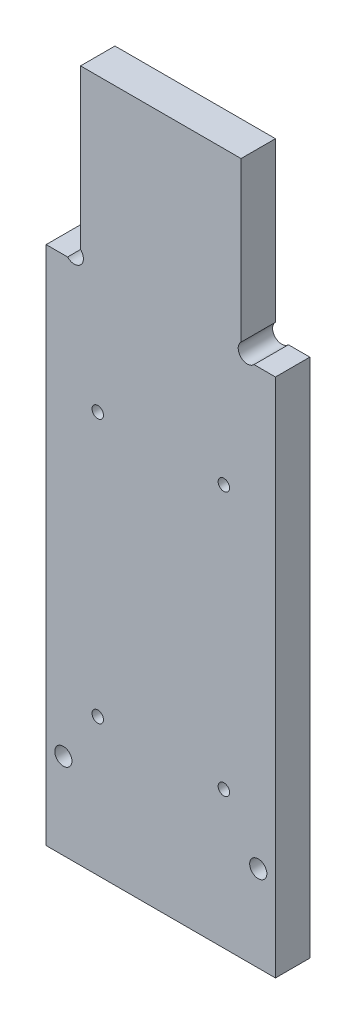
from build123d import *

# Parameters (mm, degrees)
ESQUISSE1_W             = 40
ESQUISSE1_H             = 120.8
BASE_EXTRUSION_DEPTH    = 6
ESQUISSE3_W             = 6
ESQUISSE3_H             = 30
ENL_V_MAT_EXTRU_2_DEPTH = 6
ESQUISSE2_R             = 1.5
ENL_V_MAT_EXTRU_1_DEPTH = 6
ESQUISSE5_R             = 1.6
ENL_V_MAT_EXTRU_3_DEPTH = 6
ESQUISSE6_R             = 1
ENL_V_MAT_EXTRU_4_DEPTH = 5


with BuildPart() as part:
    # Esquisse1 → Base-Extrusion (new body)
    with BuildSketch(Plane.XY):
        with Locations((-40.918360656, -10.932459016)):
            Rectangle(ESQUISSE1_W, ESQUISSE1_H)
    extrude(amount=BASE_EXTRUSION_DEPTH)

    # Esquisse3 → Enl_v. mat.-Extru.2 (cut)
    with BuildSketch(Plane.XY.offset(6)):
        with Locations((-57.918360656, 34.467540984)):
            Rectangle(ESQUISSE3_W, ESQUISSE3_H)
        with Locations((-23.918360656, 34.467540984)):
            Rectangle(ESQUISSE3_W, ESQUISSE3_H)
    extrude(amount=-ENL_V_MAT_EXTRU_2_DEPTH, mode=Mode.SUBTRACT)

    # Esquisse2 → Enl_v. mat.-Extru.1 (cut)
    with BuildSketch(Plane.XY.offset(6)):
        with Locations((-23.918360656, -56.332459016)):
            Circle(ESQUISSE2_R)
        with Locations((-57.918360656, -56.332459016)):
            Circle(ESQUISSE2_R)
    extrude(amount=-ENL_V_MAT_EXTRU_1_DEPTH, mode=Mode.SUBTRACT)

    # Esquisse5 → Enl_v. mat.-Extru.3 (cut)
    with BuildSketch(Plane.XY.offset(6)):
        with Locations((-56.018360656, 20.567540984)):
            Circle(ESQUISSE5_R)
        with Locations((-25.818360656, 20.567540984)):
            Circle(ESQUISSE5_R)
    extrude(amount=-ENL_V_MAT_EXTRU_3_DEPTH, mode=Mode.SUBTRACT)

    # Esquisse6 → Enl_v. mat.-Extru.4 (cut)
    with BuildSketch(Plane.XY.offset(6)):
        with Locations((-51.918360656, -1.332459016)):
            Circle(ESQUISSE6_R)
        with Locations((-29.918360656, -1.332459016)):
            Circle(ESQUISSE6_R)
        with Locations((-51.918360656, -47.332459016)):
            Circle(ESQUISSE6_R)
        with Locations((-29.918360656, -47.332459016)):
            Circle(ESQUISSE6_R)
    extrude(amount=-ENL_V_MAT_EXTRU_4_DEPTH, mode=Mode.SUBTRACT)


solid = part.part
